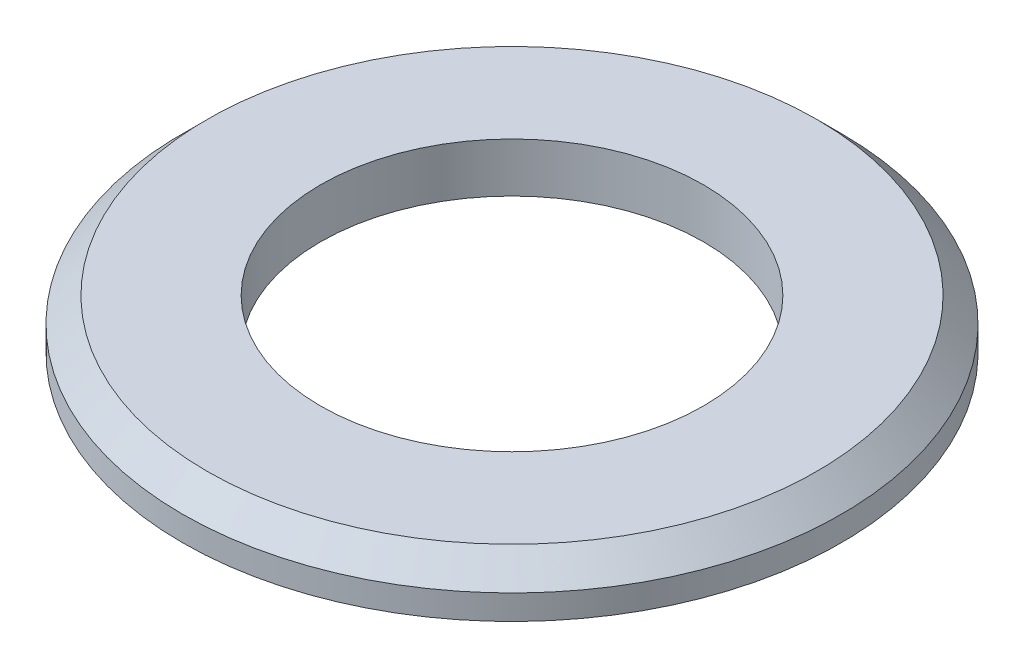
ISO-10303-21;
HEADER;
FILE_DESCRIPTION(('STEP AP214'),'2;1');
FILE_NAME('part.step','',(''),(''),'','','');
FILE_SCHEMA(('AUTOMOTIVE_DESIGN { 1 0 10303 214 1 1 1 1 }'));
ENDSEC;
DATA;
#1=APPLICATION_CONTEXT('core data for automotive mechanical design processes');
#2=APPLICATION_PROTOCOL_DEFINITION('international standard','automotive_design',2000,#1);
#3=PRODUCT_CONTEXT('',#1,'mechanical');
#4=PRODUCT('Part','Part','',(#3));
#5=PRODUCT_RELATED_PRODUCT_CATEGORY('part','',(#4));
#6=PRODUCT_DEFINITION_FORMATION('','',#4);
#7=PRODUCT_DEFINITION_CONTEXT('part definition',#1,'design');
#8=PRODUCT_DEFINITION('design','',#6,#7);
#9=PRODUCT_DEFINITION_SHAPE('','',#8);
#10=(LENGTH_UNIT() NAMED_UNIT(*) SI_UNIT(.MILLI.,.METRE.));
#11=(NAMED_UNIT(*) PLANE_ANGLE_UNIT() SI_UNIT($,.RADIAN.));
#12=(NAMED_UNIT(*) SI_UNIT($,.STERADIAN.) SOLID_ANGLE_UNIT());
#13=UNCERTAINTY_MEASURE_WITH_UNIT(LENGTH_MEASURE(1.E-05),#10,'distance_accuracy_value','');
#14=(GEOMETRIC_REPRESENTATION_CONTEXT(3) GLOBAL_UNCERTAINTY_ASSIGNED_CONTEXT((#13)) GLOBAL_UNIT_ASSIGNED_CONTEXT((#10,
#11,#12)) REPRESENTATION_CONTEXT('',''));
#15=CARTESIAN_POINT('',(0.,0.,0.));
#16=DIRECTION('',(0.,0.,1.));
#17=DIRECTION('',(1.,0.,0.));
#18=AXIS2_PLACEMENT_3D('',#15,#16,#17);
#19=CARTESIAN_POINT('',(0.,12.,0.));
#20=DIRECTION('',(0.,1.,0.));
#21=DIRECTION('',(0.,0.,1.));
#22=AXIS2_PLACEMENT_3D('',#19,#20,#21);
#23=PLANE('',#22);
#24=CARTESIAN_POINT('',(0.,12.,0.));
#25=DIRECTION('',(0.,1.,0.));
#26=DIRECTION('',(0.,0.,1.));
#27=AXIS2_PLACEMENT_3D('',#24,#25,#26);
#28=CIRCLE('',#27,74.);
#29=CARTESIAN_POINT('',(0.,12.,74.));
#30=VERTEX_POINT('',#29);
#31=EDGE_CURVE('E35',#30,#30,#28,.T.);
#32=ORIENTED_EDGE('',*,*,#31,.T.);
#33=EDGE_LOOP('',(#32));
#34=FACE_BOUND('',#33,.T.);
#35=CARTESIAN_POINT('',(0.,12.,0.));
#36=DIRECTION('',(0.,1.,0.));
#37=DIRECTION('',(0.,0.,1.));
#38=AXIS2_PLACEMENT_3D('',#35,#36,#37);
#39=CIRCLE('',#38,46.5);
#40=CARTESIAN_POINT('',(0.,12.,46.5));
#41=VERTEX_POINT('',#40);
#42=EDGE_CURVE('E43',#41,#41,#39,.T.);
#43=ORIENTED_EDGE('',*,*,#42,.F.);
#44=EDGE_LOOP('',(#43));
#45=FACE_BOUND('',#44,.T.);
#46=ADVANCED_FACE('F28',(#34,#45),#23,.T.);
#47=CARTESIAN_POINT('',(0.,0.,0.));
#48=DIRECTION('',(0.,1.,0.));
#49=DIRECTION('',(0.,0.,1.));
#50=AXIS2_PLACEMENT_3D('',#47,#48,#49);
#51=PLANE('',#50);
#52=CARTESIAN_POINT('',(0.,0.,0.));
#53=DIRECTION('',(0.,1.,0.));
#54=DIRECTION('',(0.,0.,1.));
#55=AXIS2_PLACEMENT_3D('',#52,#53,#54);
#56=CIRCLE('',#55,80.);
#57=CARTESIAN_POINT('',(0.,0.,80.));
#58=VERTEX_POINT('',#57);
#59=EDGE_CURVE('E39',#58,#58,#56,.T.);
#60=ORIENTED_EDGE('',*,*,#59,.F.);
#61=EDGE_LOOP('',(#60));
#62=FACE_BOUND('',#61,.T.);
#63=CARTESIAN_POINT('',(0.,0.,0.));
#64=DIRECTION('',(0.,1.,0.));
#65=DIRECTION('',(0.,0.,1.));
#66=AXIS2_PLACEMENT_3D('',#63,#64,#65);
#67=CIRCLE('',#66,46.5);
#68=CARTESIAN_POINT('',(0.,0.,46.5));
#69=VERTEX_POINT('',#68);
#70=EDGE_CURVE('E48',#69,#69,#67,.T.);
#71=ORIENTED_EDGE('',*,*,#70,.T.);
#72=EDGE_LOOP('',(#71));
#73=FACE_BOUND('',#72,.T.);
#74=ADVANCED_FACE('F52',(#62,#73),#51,.F.);
#75=CARTESIAN_POINT('',(0.,12.,0.));
#76=DIRECTION('',(0.,-1.,0.));
#77=DIRECTION('',(0.,0.,-1.));
#78=AXIS2_PLACEMENT_3D('',#75,#76,#77);
#79=CYLINDRICAL_SURFACE('',#78,80.);
#80=CARTESIAN_POINT('',(0.,5.99999999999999,0.));
#81=DIRECTION('',(0.,1.,0.));
#82=DIRECTION('',(0.,0.,1.));
#83=AXIS2_PLACEMENT_3D('',#80,#81,#82);
#84=CIRCLE('',#83,80.);
#85=CARTESIAN_POINT('',(0.,5.99999999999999,80.));
#86=VERTEX_POINT('',#85);
#87=EDGE_CURVE('E10',#86,#86,#84,.F.);
#88=ORIENTED_EDGE('',*,*,#87,.T.);
#89=EDGE_LOOP('',(#88));
#90=FACE_BOUND('',#89,.T.);
#91=ORIENTED_EDGE('',*,*,#59,.T.);
#92=EDGE_LOOP('',(#91));
#93=FACE_BOUND('',#92,.T.);
#94=ADVANCED_FACE('F30',(#90,#93),#79,.T.);
#95=CARTESIAN_POINT('',(0.,12.,0.));
#96=DIRECTION('',(0.,-1.,0.));
#97=DIRECTION('',(0.,0.,-1.));
#98=AXIS2_PLACEMENT_3D('',#95,#96,#97);
#99=CYLINDRICAL_SURFACE('',#98,46.5);
#100=ORIENTED_EDGE('',*,*,#42,.T.);
#101=EDGE_LOOP('',(#100));
#102=FACE_BOUND('',#101,.T.);
#103=ORIENTED_EDGE('',*,*,#70,.F.);
#104=EDGE_LOOP('',(#103));
#105=FACE_BOUND('',#104,.T.);
#106=ADVANCED_FACE('F54',(#102,#105),#99,.F.);
#107=CARTESIAN_POINT('',(0.,12.,0.));
#108=DIRECTION('',(0.,-1.,0.));
#109=DIRECTION('',(0.,0.,-1.));
#110=AXIS2_PLACEMENT_3D('',#107,#108,#109);
#111=CONICAL_SURFACE('',#110,74.,0.78539816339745);
#112=ORIENTED_EDGE('',*,*,#87,.F.);
#113=EDGE_LOOP('',(#112));
#114=FACE_BOUND('',#113,.T.);
#115=ORIENTED_EDGE('',*,*,#31,.F.);
#116=EDGE_LOOP('',(#115));
#117=FACE_BOUND('',#116,.T.);
#118=ADVANCED_FACE('F56',(#114,#117),#111,.T.);
#119=CLOSED_SHELL('',(#46,#74,#94,#106,#118));
#120=MANIFOLD_SOLID_BREP('B2',#119);
#121=ADVANCED_BREP_SHAPE_REPRESENTATION('',(#18,#120),#14);
#122=SHAPE_DEFINITION_REPRESENTATION(#9,#121);
ENDSEC;
END-ISO-10303-21;
